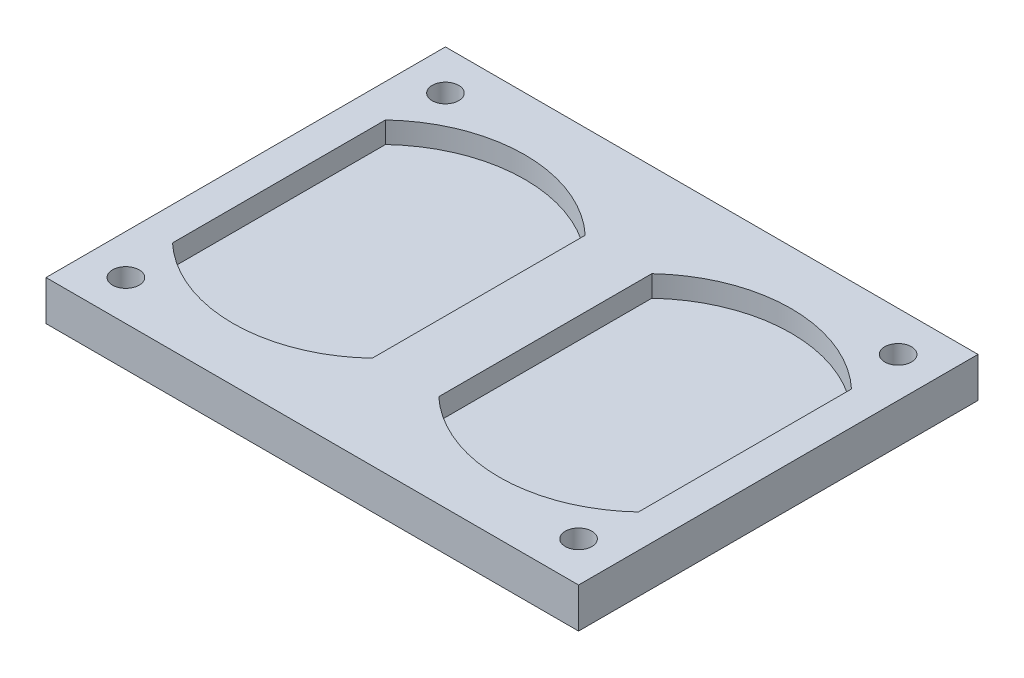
from build123d import *

# Parameters (mm, degrees)
SKETCH1_W                  = 200
SKETCH1_H                  = 150
BOSS_EXTRUDE1_DEPTH        = 15
CUT_EXTRUDE1_DEPTH         = 8
F_10_0_10_DIAMETER_HOLE1_D = 10


with BuildPart() as part:
    # Sketch1 → Boss-Extrude1 (new body)
    with BuildSketch(Plane(origin=(0, 0, 0), x_dir=(1, 0, 0), z_dir=(0, 1, 0))):
        Rectangle(SKETCH1_W, SKETCH1_H)
    extrude(amount=BOSS_EXTRUDE1_DEPTH)

    # Sketch2 → Cut-Extrude1 (cut)
    with BuildSketch(Plane(origin=(0, 15, 0), x_dir=(1, 0, 0), z_dir=(0, 1, 0))):
        with BuildLine():
            Line((12.5, -40), (12.5, 40))
            ThreePointArc((12.5, 40), (50, 54.829280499), (87.5, 40))
            Line((87.5, 40), (87.5, -40))
            ThreePointArc((87.5, -40), (50, -54.829280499), (12.5, -40))
        make_face()
        with BuildLine():
            Line((-87.5, -40), (-87.5, 40))
            ThreePointArc((-87.5, 40), (-50, 54.829280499), (-12.5, 40))
            Line((-12.5, 40), (-12.5, -40))
            ThreePointArc((-12.5, -40), (-50, -54.829280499), (-87.5, -40))
        make_face()
    extrude(amount=-CUT_EXTRUDE1_DEPTH, mode=Mode.SUBTRACT)

    # 10.0 _10_ Diameter Hole1 (through all)
    with Locations(Plane(origin=(0, 15, 0), x_dir=(1, 0, 0), z_dir=(0, 1, 0))):
        with Locations((-85, 60), (85, 60), (85, -60), (-85, -60)):
            Hole(F_10_0_10_DIAMETER_HOLE1_D / 2)


solid = part.part
